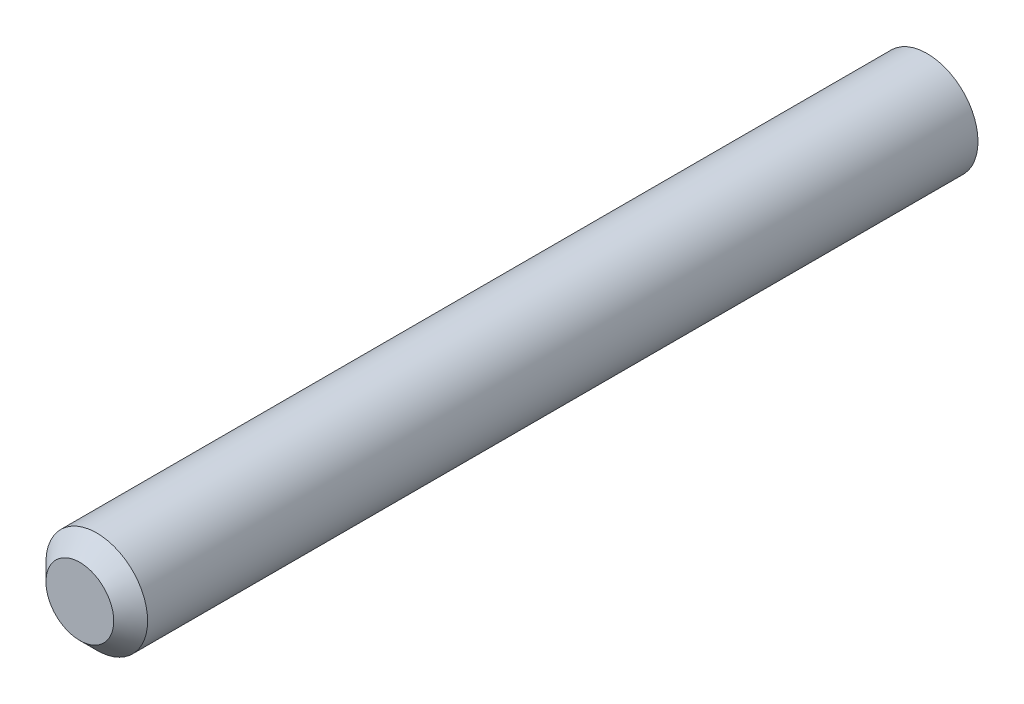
ISO-10303-21;
HEADER;
FILE_DESCRIPTION(('STEP AP214'),'2;1');
FILE_NAME('part.step','',(''),(''),'','','');
FILE_SCHEMA(('AUTOMOTIVE_DESIGN { 1 0 10303 214 1 1 1 1 }'));
ENDSEC;
DATA;
#1=APPLICATION_CONTEXT('core data for automotive mechanical design processes');
#2=APPLICATION_PROTOCOL_DEFINITION('international standard','automotive_design',2000,#1);
#3=PRODUCT_CONTEXT('',#1,'mechanical');
#4=PRODUCT('Part','Part','',(#3));
#5=PRODUCT_RELATED_PRODUCT_CATEGORY('part','',(#4));
#6=PRODUCT_DEFINITION_FORMATION('','',#4);
#7=PRODUCT_DEFINITION_CONTEXT('part definition',#1,'design');
#8=PRODUCT_DEFINITION('design','',#6,#7);
#9=PRODUCT_DEFINITION_SHAPE('','',#8);
#10=(LENGTH_UNIT() NAMED_UNIT(*) SI_UNIT(.MILLI.,.METRE.));
#11=(NAMED_UNIT(*) PLANE_ANGLE_UNIT() SI_UNIT($,.RADIAN.));
#12=(NAMED_UNIT(*) SI_UNIT($,.STERADIAN.) SOLID_ANGLE_UNIT());
#13=UNCERTAINTY_MEASURE_WITH_UNIT(LENGTH_MEASURE(1.E-05),#10,'distance_accuracy_value','');
#14=(GEOMETRIC_REPRESENTATION_CONTEXT(3) GLOBAL_UNCERTAINTY_ASSIGNED_CONTEXT((#13)) GLOBAL_UNIT_ASSIGNED_CONTEXT((#10,
#11,#12)) REPRESENTATION_CONTEXT('',''));
#15=CARTESIAN_POINT('',(0.,0.,0.));
#16=DIRECTION('',(0.,0.,1.));
#17=DIRECTION('',(1.,0.,0.));
#18=AXIS2_PLACEMENT_3D('',#15,#16,#17);
#19=CARTESIAN_POINT('',(0.,0.,50.));
#20=DIRECTION('',(0.,0.,-1.));
#21=DIRECTION('',(-1.,0.,0.));
#22=AXIS2_PLACEMENT_3D('',#19,#20,#21);
#23=CYLINDRICAL_SURFACE('',#22,3.);
#24=CARTESIAN_POINT('',(0.,0.,49.));
#25=DIRECTION('',(0.,0.,1.));
#26=DIRECTION('',(1.,0.,0.));
#27=AXIS2_PLACEMENT_3D('',#24,#25,#26);
#28=CIRCLE('',#27,3.);
#29=CARTESIAN_POINT('',(3.,0.,49.));
#30=VERTEX_POINT('',#29);
#31=EDGE_CURVE('E10',#30,#30,#28,.F.);
#32=ORIENTED_EDGE('',*,*,#31,.T.);
#33=EDGE_LOOP('',(#32));
#34=FACE_BOUND('',#33,.T.);
#35=CARTESIAN_POINT('',(0.,0.,0.));
#36=DIRECTION('',(0.,0.,1.));
#37=DIRECTION('',(1.,0.,0.));
#38=AXIS2_PLACEMENT_3D('',#35,#36,#37);
#39=CIRCLE('',#38,3.);
#40=CARTESIAN_POINT('',(3.,0.,0.));
#41=VERTEX_POINT('',#40);
#42=EDGE_CURVE('E53',#41,#41,#39,.T.);
#43=ORIENTED_EDGE('',*,*,#42,.T.);
#44=EDGE_LOOP('',(#43));
#45=FACE_BOUND('',#44,.T.);
#46=ADVANCED_FACE('F40',(#34,#45),#23,.T.);
#47=CARTESIAN_POINT('',(0.,0.,50.));
#48=DIRECTION('',(0.,0.,1.));
#49=DIRECTION('',(1.,0.,0.));
#50=AXIS2_PLACEMENT_3D('',#47,#48,#49);
#51=PLANE('',#50);
#52=CARTESIAN_POINT('',(0.,0.,50.));
#53=DIRECTION('',(0.,0.,1.));
#54=DIRECTION('',(1.,0.,0.));
#55=AXIS2_PLACEMENT_3D('',#52,#53,#54);
#56=CIRCLE('',#55,2.);
#57=CARTESIAN_POINT('',(2.,0.,50.));
#58=VERTEX_POINT('',#57);
#59=EDGE_CURVE('E47',#58,#58,#56,.T.);
#60=ORIENTED_EDGE('',*,*,#59,.T.);
#61=EDGE_LOOP('',(#60));
#62=FACE_BOUND('',#61,.T.);
#63=ADVANCED_FACE('F64',(#62),#51,.T.);
#64=CARTESIAN_POINT('',(0.,0.,0.));
#65=DIRECTION('',(0.,0.,1.));
#66=DIRECTION('',(1.,0.,0.));
#67=AXIS2_PLACEMENT_3D('',#64,#65,#66);
#68=PLANE('',#67);
#69=ORIENTED_EDGE('',*,*,#42,.F.);
#70=EDGE_LOOP('',(#69));
#71=FACE_BOUND('',#70,.T.);
#72=ADVANCED_FACE('F61',(#71),#68,.F.);
#73=CARTESIAN_POINT('',(0.,0.,50.));
#74=DIRECTION('',(0.,0.,-1.));
#75=DIRECTION('',(-1.,0.,0.));
#76=AXIS2_PLACEMENT_3D('',#73,#74,#75);
#77=CONICAL_SURFACE('',#76,2.,0.785398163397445);
#78=ORIENTED_EDGE('',*,*,#31,.F.);
#79=EDGE_LOOP('',(#78));
#80=FACE_BOUND('',#79,.T.);
#81=ORIENTED_EDGE('',*,*,#59,.F.);
#82=EDGE_LOOP('',(#81));
#83=FACE_BOUND('',#82,.T.);
#84=ADVANCED_FACE('F63',(#80,#83),#77,.T.);
#85=CLOSED_SHELL('',(#46,#63,#72,#84));
#86=MANIFOLD_SOLID_BREP('B2',#85);
#87=ADVANCED_BREP_SHAPE_REPRESENTATION('',(#18,#86),#14);
#88=SHAPE_DEFINITION_REPRESENTATION(#9,#87);
ENDSEC;
END-ISO-10303-21;
